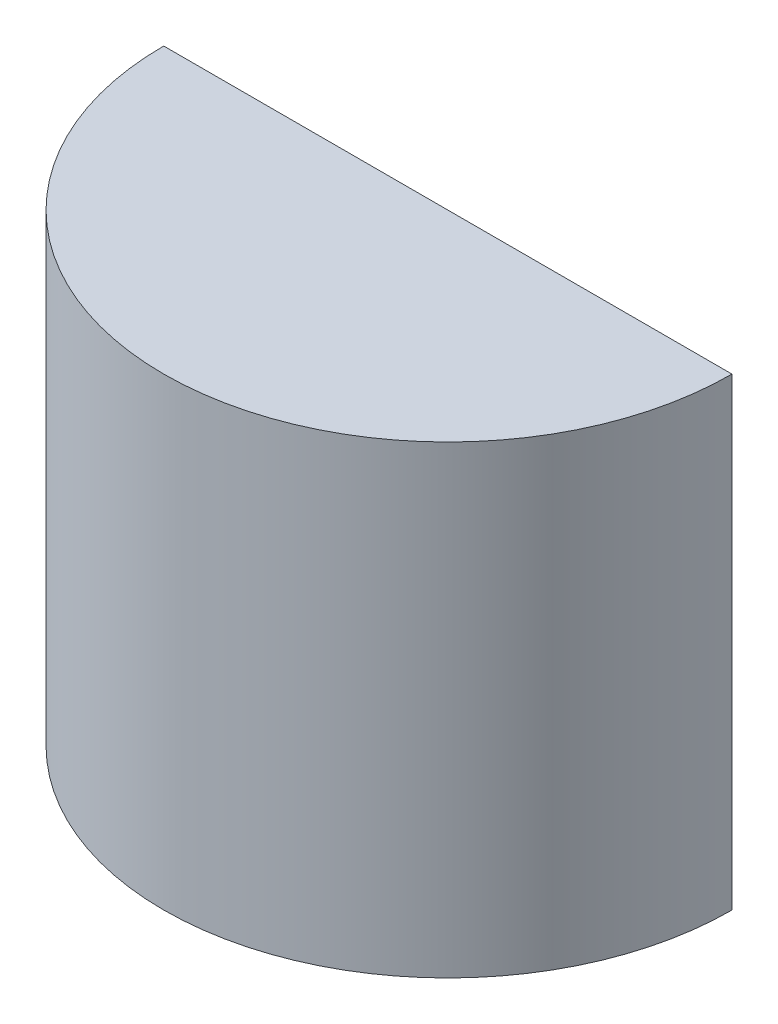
from build123d import *

# Parameters (mm, degrees)
SKETCH1_W          = 143.33802741
SKETCH1_H          = 180.786701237
CUT_EXTRUDE1_DEPTH = 97.568628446


with BuildPart() as part:
    # Sketch 1 → Revolve 1 (revolve)
    with BuildSketch(Plane(origin=(0, 0, 0), x_dir=(0, 0, -1), z_dir=(1, 0, 0)), mode=Mode.PRIVATE) as revolve_1_sk:
        Polygon((-45.5, 65), (-50.5, 65), (-50.5, -17.501381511), (-46.520913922, -17.501381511), (-45.5, 0), (-42, 60), (0, 60), (0, 65), align=None)
    revolve(revolve_1_sk.sketch.rotate(Axis((0, 0, 0), (0, 1, 0)), 180), axis=Axis((0, 0, 0), (0, 1, 0)))

    # Sketch1 → Cut-Extrude1 (cut, through all)
    with BuildSketch(Plane.XY):
        with Locations((-3.805567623, -5.182133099)):
            Rectangle(SKETCH1_W, SKETCH1_H)
    extrude(amount=-CUT_EXTRUDE1_DEPTH, mode=Mode.SUBTRACT)


solid = part.part
